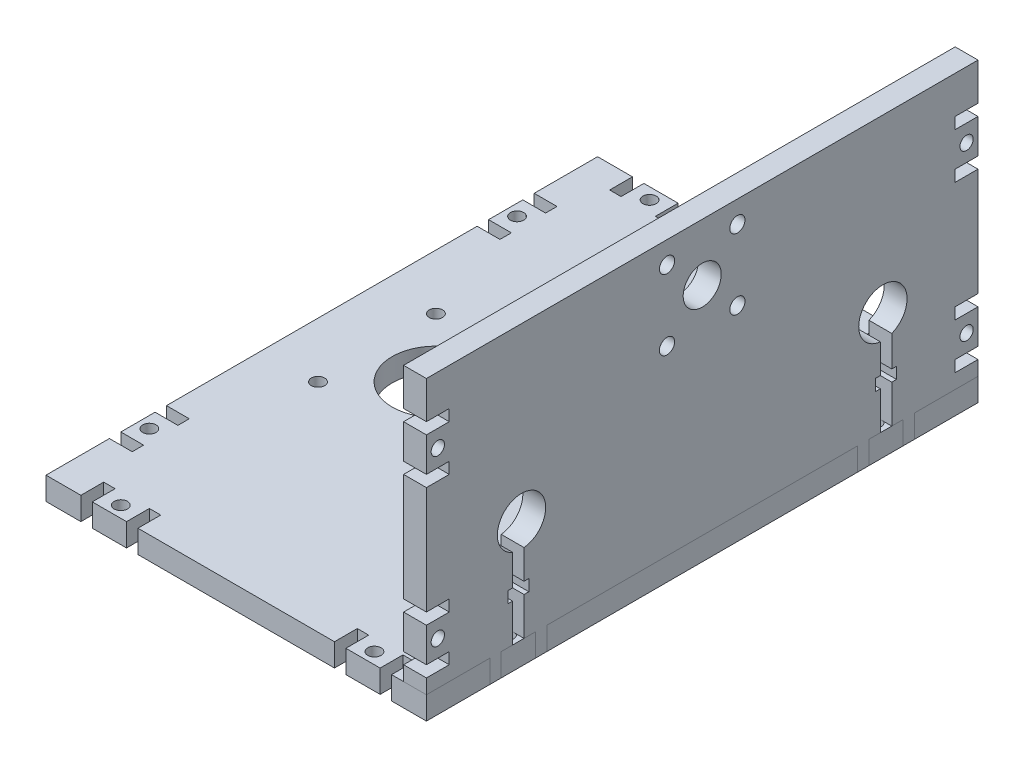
from build123d import *

# Parameters (mm, degrees)
SKETCH1_W           = 100
SKETCH1_H           = 145
BOSS_EXTRUDE1_DEPTH = 6
SKETCH2_R           = 1.75
SKETCH2_W           = 6
SKETCH2_H           = 3
SKETCH2_W_2         = 3
SKETCH2_H_2         = 6
CUT_EXTRUDE1_DEPTH  = 89.273722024
SKETCH3_R           = 11.5
SKETCH3_R_2         = 1.75
CUT_EXTRUDE2_DEPTH  = 89.273722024
BOSS_EXTRUDE2_DEPTH = 6
SKETCH5_R           = 1.75
SKETCH5_W           = 6
SKETCH5_H           = 3
CUT_EXTRUDE3_DEPTH  = 147.083024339
SKETCH6_R           = 5
SKETCH6_R_2         = 6.35
SKETCH6_R_3         = 2
CUT_EXTRUDE4_DEPTH  = 147.083024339
CUT_EXTRUDE5_DEPTH  = 147.083024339


with BuildPart() as part:
    # Sketch1 → Boss-Extrude1 (new body)
    with BuildSketch(Plane(origin=(0, 0, 0), x_dir=(1, 0, 0), z_dir=(0, 1, 0))):
        Rectangle(SKETCH1_W, SKETCH1_H)
    extrude(amount=BOSS_EXTRUDE1_DEPTH)

    # Sketch2 → Cut-Extrude1 (cut, through all)
    with BuildSketch(Plane(origin=(0, 6, 0), x_dir=(1, 0, 0), z_dir=(0, 1, 0))):
        with Locations(Location((-33.333333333, 69.5, 0), (0, 0, 270))):
            Circle(SKETCH2_R)
        with Locations(Location((-47, 48.333333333, 0), (0, 0, 270))):
            Circle(SKETCH2_R)
        with Locations(Location((47, 48.333333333, 0), (0, 0, 90))):
            Circle(SKETCH2_R)
        with Locations(Location((33.333333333, 69.5, 0), (0, 0, 90))):
            Circle(SKETCH2_R)
        with Locations(Location((47, -48.333333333, 0), (0, 0, 270))):
            Circle(SKETCH2_R)
        with Locations(Location((33.333333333, -69.5, 0), (0, 0, 270))):
            Circle(SKETCH2_R)
        with Locations(Location((-47, -48.333333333, 0), (0, 0, 90))):
            Circle(SKETCH2_R)
        with Locations(Location((-33.333333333, -69.5, 0), (0, 0, 90))):
            Circle(SKETCH2_R)
        with Locations((-47, 54.333333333)):
            Rectangle(SKETCH2_W, SKETCH2_H)
        with Locations((-39.333333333, 69.5)):
            Rectangle(SKETCH2_W_2, SKETCH2_H_2)
        with Locations((-27.333333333, 69.5)):
            Rectangle(SKETCH2_W_2, SKETCH2_H_2)
        with Locations((-47, 42.333333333)):
            Rectangle(SKETCH2_W, SKETCH2_H)
        with Locations((47, 42.333333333)):
            Rectangle(SKETCH2_W, SKETCH2_H)
        with Locations((47, 54.333333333)):
            Rectangle(SKETCH2_W, SKETCH2_H)
        with Locations((39.333333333, 69.5)):
            Rectangle(SKETCH2_W_2, SKETCH2_H_2)
        with Locations((27.333333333, 69.5)):
            Rectangle(SKETCH2_W_2, SKETCH2_H_2)
        with Locations((47, -42.333333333)):
            Rectangle(SKETCH2_W, SKETCH2_H)
        with Locations((47, -54.333333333)):
            Rectangle(SKETCH2_W, SKETCH2_H)
        with Locations((39.333333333, -69.5)):
            Rectangle(SKETCH2_W_2, SKETCH2_H_2)
        with Locations((27.333333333, -69.5)):
            Rectangle(SKETCH2_W_2, SKETCH2_H_2)
        with Locations((-47, -42.333333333)):
            Rectangle(SKETCH2_W, SKETCH2_H)
        with Locations((-47, -54.333333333)):
            Rectangle(SKETCH2_W, SKETCH2_H)
        with Locations((-39.333333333, -69.5)):
            Rectangle(SKETCH2_W_2, SKETCH2_H_2)
        with Locations((-27.333333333, -69.5)):
            Rectangle(SKETCH2_W_2, SKETCH2_H_2)
    extrude(amount=-CUT_EXTRUDE1_DEPTH, mode=Mode.SUBTRACT)

    # Sketch3 → Cut-Extrude2 (cut, through all)
    with BuildSketch(Plane(origin=(0, 6, 0), x_dir=(1, 0, 0), z_dir=(0, 1, 0))):
        with Locations(Location((-20, 0, 0), (0, 0, 270))):
            Circle(SKETCH3_R)
        with Locations(Location((-4.5, 15.5, 0), (0, 0, 270))):
            Circle(SKETCH3_R_2)
        with Locations(Location((-35.5, 15.5, 0), (0, 0, 270))):
            Circle(SKETCH3_R_2)
        with Locations(Location((-35.5, -15.5, 0), (0, 0, 90))):
            Circle(SKETCH3_R_2)
        with Locations(Location((-4.5, -15.5, 0), (0, 0, 90))):
            Circle(SKETCH3_R_2)
    extrude(amount=-CUT_EXTRUDE2_DEPTH, mode=Mode.SUBTRACT)


with BuildPart() as body_2:
    # Sketch4 → Boss-Extrude2 (new body)
    with BuildSketch(Plane(origin=(44, 0, 0), x_dir=(0, 0, -1), z_dir=(1, 0, 0))):
        Polygon((-72.5, 6), (-55.833333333, 6), (-55.833333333, 0), (-52.833333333, 0), (-52.833333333, 6), (-43.833333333, 6), (-43.833333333, 0), (-40.833333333, 0), (-40.833333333, 6), (40.833333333, 6), (40.833333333, 0), (43.833333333, 0), (43.833333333, 6), (52.833333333, 6), (52.833333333, 0), (55.833333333, 0), (55.833333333, 6), (72.5, 6), (72.5, 78), (-72.5, 78), align=None)
    extrude(amount=BOSS_EXTRUDE2_DEPTH)

    # Sketch5 → Cut-Extrude3 (cut, through all)
    with BuildSketch(Plane(origin=(50, 0, 0), x_dir=(0, 0, -1), z_dir=(1, 0, 0))):
        with Locations((-69.5, 60.666666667)):
            Circle(SKETCH5_R)
        with Locations((-69.5, 17.333333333)):
            Circle(SKETCH5_R)
        with Locations((69.5, 17.333333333)):
            Circle(SKETCH5_R)
        with Locations((69.5, 60.666666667)):
            Circle(SKETCH5_R)
        with Locations((-69.5, 66.666666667)):
            Rectangle(SKETCH5_W, SKETCH5_H)
        with Locations((-69.5, 54.666666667)):
            Rectangle(SKETCH5_W, SKETCH5_H)
        with Locations((-69.5, 23.333333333)):
            Rectangle(SKETCH5_W, SKETCH5_H)
        with Locations((-69.5, 11.333333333)):
            Rectangle(SKETCH5_W, SKETCH5_H)
        with Locations((69.5, 11.333333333)):
            Rectangle(SKETCH5_W, SKETCH5_H)
        with Locations((69.5, 23.333333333)):
            Rectangle(SKETCH5_W, SKETCH5_H)
        with Locations((69.5, 54.666666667)):
            Rectangle(SKETCH5_W, SKETCH5_H)
        with Locations((69.5, 66.666666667)):
            Rectangle(SKETCH5_W, SKETCH5_H)
    extrude(amount=-CUT_EXTRUDE3_DEPTH, mode=Mode.SUBTRACT)

    # Sketch6 → Cut-Extrude4 (cut, through all)
    with BuildSketch(Plane(origin=(50, 0, 0), x_dir=(0, 0, -1), z_dir=(1, 0, 0))):
        with Locations((0, 63)):
            Circle(SKETCH6_R)
        with Locations((-47.5, 33)):
            Circle(SKETCH6_R_2)
        with Locations((47.5, 33)):
            Circle(SKETCH6_R_2)
        with Locations((-9.25, 72.25)):
            Circle(SKETCH6_R_3)
        with Locations((9.25, 72.25)):
            Circle(SKETCH6_R_3)
        with Locations((9.25, 53.75)):
            Circle(SKETCH6_R_3)
        with Locations((-9.25, 53.75)):
            Circle(SKETCH6_R_3)
    extrude(amount=-CUT_EXTRUDE4_DEPTH, mode=Mode.SUBTRACT)

    # Sketch7 → Cut-Extrude5 (cut, through all)
    with BuildSketch(Plane(origin=(50, 0, 0), x_dir=(0, 0, -1), z_dir=(1, 0, 0))):
        Polygon((-49.833333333, 6), (-46.833333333, 6), (-46.833333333, 16), (-45.577433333, 16), (-45.577433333, 19), (-46.833333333, 19), (-46.833333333, 30), (-49.833333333, 30), (-49.833333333, 19), (-51.089233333, 19), (-51.089233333, 16), (-49.833333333, 16), align=None)
        Polygon((46.833333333, 30), (46.833333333, 19), (45.577433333, 19), (45.577433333, 16), (46.833333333, 16), (46.833333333, 6), (49.833333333, 6), (49.833333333, 16), (51.089233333, 16), (51.089233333, 19), (49.833333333, 19), (49.833333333, 30), align=None)
    extrude(amount=-CUT_EXTRUDE5_DEPTH, mode=Mode.SUBTRACT)


solid = Compound([part.part, body_2.part])
